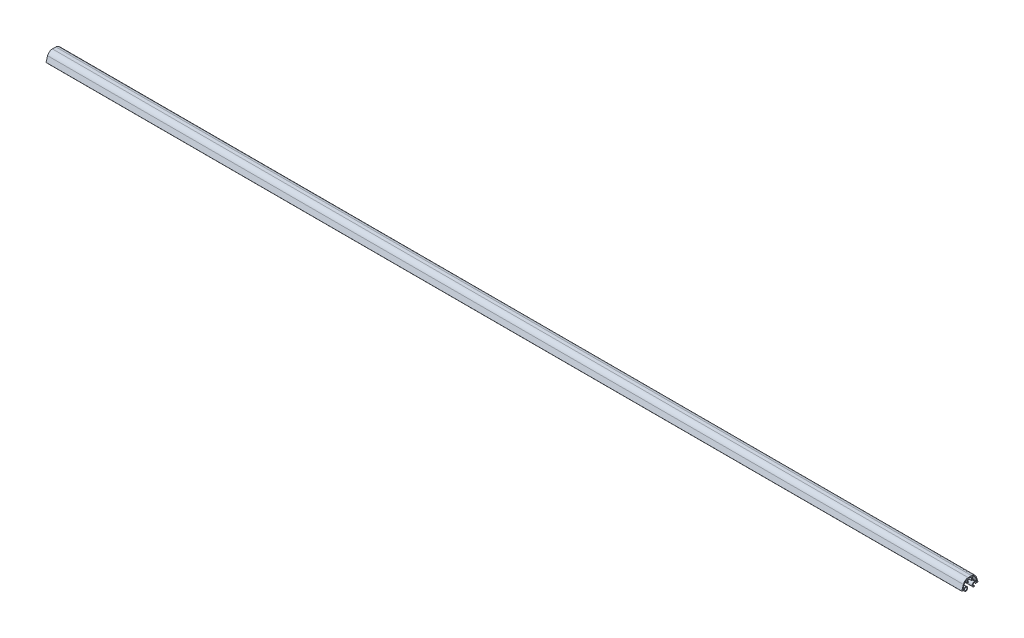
ISO-10303-21;
HEADER;
FILE_DESCRIPTION(('STEP AP214'),'2;1');
FILE_NAME('part.step','',(''),(''),'','','');
FILE_SCHEMA(('AUTOMOTIVE_DESIGN { 1 0 10303 214 1 1 1 1 }'));
ENDSEC;
DATA;
#1=APPLICATION_CONTEXT('core data for automotive mechanical design processes');
#2=APPLICATION_PROTOCOL_DEFINITION('international standard','automotive_design',2000,#1);
#3=PRODUCT_CONTEXT('',#1,'mechanical');
#4=PRODUCT('Part','Part','',(#3));
#5=PRODUCT_RELATED_PRODUCT_CATEGORY('part','',(#4));
#6=PRODUCT_DEFINITION_FORMATION('','',#4);
#7=PRODUCT_DEFINITION_CONTEXT('part definition',#1,'design');
#8=PRODUCT_DEFINITION('design','',#6,#7);
#9=PRODUCT_DEFINITION_SHAPE('','',#8);
#10=(LENGTH_UNIT() NAMED_UNIT(*) SI_UNIT(.MILLI.,.METRE.));
#11=(NAMED_UNIT(*) PLANE_ANGLE_UNIT() SI_UNIT($,.RADIAN.));
#12=(NAMED_UNIT(*) SI_UNIT($,.STERADIAN.) SOLID_ANGLE_UNIT());
#13=UNCERTAINTY_MEASURE_WITH_UNIT(LENGTH_MEASURE(1.E-05),#10,'distance_accuracy_value','');
#14=(GEOMETRIC_REPRESENTATION_CONTEXT(3) GLOBAL_UNCERTAINTY_ASSIGNED_CONTEXT((#13)) GLOBAL_UNIT_ASSIGNED_CONTEXT((#10,
#11,#12)) REPRESENTATION_CONTEXT('',''));
#15=CARTESIAN_POINT('',(0.,0.,0.));
#16=DIRECTION('',(0.,0.,1.));
#17=DIRECTION('',(1.,0.,0.));
#18=AXIS2_PLACEMENT_3D('',#15,#16,#17);
#19=CARTESIAN_POINT('',(1087.,0.,-2.));
#20=DIRECTION('',(-1.,0.,0.));
#21=DIRECTION('',(0.,0.,1.));
#22=AXIS2_PLACEMENT_3D('',#19,#20,#21);
#23=CYLINDRICAL_SURFACE('',#22,6.);
#24=CARTESIAN_POINT('',(0.,0.,-2.));
#25=DIRECTION('',(1.,0.,0.));
#26=DIRECTION('',(0.,0.,-1.));
#27=AXIS2_PLACEMENT_3D('',#24,#25,#26);
#28=CIRCLE('',#27,6.);
#29=CARTESIAN_POINT('',(0.,1.84912600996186,-7.7079534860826));
#30=VERTEX_POINT('',#29);
#31=CARTESIAN_POINT('',(0.,6.,-1.99999999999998));
#32=VERTEX_POINT('',#31);
#33=EDGE_CURVE('E331',#30,#32,#28,.T.);
#34=ORIENTED_EDGE('',*,*,#33,.T.);
#35=DIRECTION('',(-1.,0.,0.));
#36=VECTOR('',#35,1.);
#37=CARTESIAN_POINT('',(1087.,6.,-1.99999999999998));
#38=LINE('',#37,#36);
#39=CARTESIAN_POINT('',(1087.,6.,-1.99999999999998));
#40=VERTEX_POINT('',#39);
#41=EDGE_CURVE('E11',#40,#32,#38,.T.);
#42=ORIENTED_EDGE('',*,*,#41,.F.);
#43=CARTESIAN_POINT('',(1087.,0.,-2.));
#44=DIRECTION('',(1.,0.,0.));
#45=DIRECTION('',(0.,0.,-1.));
#46=AXIS2_PLACEMENT_3D('',#43,#44,#45);
#47=CIRCLE('',#46,6.);
#48=CARTESIAN_POINT('',(1087.,1.84912600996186,-7.7079534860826));
#49=VERTEX_POINT('',#48);
#50=EDGE_CURVE('E415',#49,#40,#47,.T.);
#51=ORIENTED_EDGE('',*,*,#50,.F.);
#52=DIRECTION('',(-1.,0.,0.));
#53=VECTOR('',#52,1.);
#54=CARTESIAN_POINT('',(1087.,1.84912600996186,-7.7079534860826));
#55=LINE('',#54,#53);
#56=EDGE_CURVE('E327',#49,#30,#55,.T.);
#57=ORIENTED_EDGE('',*,*,#56,.T.);
#58=EDGE_LOOP('',(#34,#42,#51,#57));
#59=FACE_BOUND('',#58,.T.);
#60=ADVANCED_FACE('F32',(#59),#23,.T.);
#61=CARTESIAN_POINT('',(1087.,6.,-1.99999999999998));
#62=DIRECTION('',(0.,-1.,0.));
#63=DIRECTION('',(0.,0.,-1.));
#64=AXIS2_PLACEMENT_3D('',#61,#62,#63);
#65=PLANE('',#64);
#66=DIRECTION('',(0.,0.,1.));
#67=VECTOR('',#66,1.);
#68=CARTESIAN_POINT('',(0.,6.,-1.99999999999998));
#69=LINE('',#68,#67);
#70=CARTESIAN_POINT('',(0.,6.,1.99999999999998));
#71=VERTEX_POINT('',#70);
#72=EDGE_CURVE('E334',#32,#71,#69,.T.);
#73=ORIENTED_EDGE('',*,*,#72,.T.);
#74=DIRECTION('',(-1.,0.,0.));
#75=VECTOR('',#74,1.);
#76=CARTESIAN_POINT('',(1087.,6.,1.99999999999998));
#77=LINE('',#76,#75);
#78=CARTESIAN_POINT('',(1087.,6.,1.99999999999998));
#79=VERTEX_POINT('',#78);
#80=EDGE_CURVE('E40',#79,#71,#77,.T.);
#81=ORIENTED_EDGE('',*,*,#80,.F.);
#82=DIRECTION('',(0.,0.,1.));
#83=VECTOR('',#82,1.);
#84=CARTESIAN_POINT('',(1087.,6.,-1.99999999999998));
#85=LINE('',#84,#83);
#86=EDGE_CURVE('E193',#40,#79,#85,.T.);
#87=ORIENTED_EDGE('',*,*,#86,.F.);
#88=ORIENTED_EDGE('',*,*,#41,.T.);
#89=EDGE_LOOP('',(#73,#81,#87,#88));
#90=FACE_BOUND('',#89,.T.);
#91=ADVANCED_FACE('F643',(#90),#65,.F.);
#92=CARTESIAN_POINT('',(1087.,0.,2.));
#93=DIRECTION('',(-1.,0.,0.));
#94=DIRECTION('',(0.,0.,1.));
#95=AXIS2_PLACEMENT_3D('',#92,#93,#94);
#96=CYLINDRICAL_SURFACE('',#95,6.);
#97=CARTESIAN_POINT('',(0.,0.,2.));
#98=DIRECTION('',(1.,0.,0.));
#99=DIRECTION('',(0.,0.,1.));
#100=AXIS2_PLACEMENT_3D('',#97,#98,#99);
#101=CIRCLE('',#100,6.);
#102=CARTESIAN_POINT('',(0.,1.84912600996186,7.7079534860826));
#103=VERTEX_POINT('',#102);
#104=EDGE_CURVE('E336',#71,#103,#101,.T.);
#105=ORIENTED_EDGE('',*,*,#104,.T.);
#106=DIRECTION('',(-1.,0.,0.));
#107=VECTOR('',#106,1.);
#108=CARTESIAN_POINT('',(1087.,1.84912600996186,7.7079534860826));
#109=LINE('',#108,#107);
#110=CARTESIAN_POINT('',(1087.,1.84912600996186,7.7079534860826));
#111=VERTEX_POINT('',#110);
#112=EDGE_CURVE('E524',#111,#103,#109,.T.);
#113=ORIENTED_EDGE('',*,*,#112,.F.);
#114=CARTESIAN_POINT('',(1087.,0.,2.));
#115=DIRECTION('',(1.,0.,0.));
#116=DIRECTION('',(0.,0.,1.));
#117=AXIS2_PLACEMENT_3D('',#114,#115,#116);
#118=CIRCLE('',#117,6.);
#119=EDGE_CURVE('E532',#79,#111,#118,.T.);
#120=ORIENTED_EDGE('',*,*,#119,.F.);
#121=ORIENTED_EDGE('',*,*,#80,.T.);
#122=EDGE_LOOP('',(#105,#113,#120,#121));
#123=FACE_BOUND('',#122,.T.);
#124=ADVANCED_FACE('F530',(#123),#96,.T.);
#125=CARTESIAN_POINT('',(1087.,1.84912600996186,7.7079534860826));
#126=DIRECTION('',(0.,-0.308187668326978,-0.951325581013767));
#127=DIRECTION('',(0.,0.951325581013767,-0.308187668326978));
#128=AXIS2_PLACEMENT_3D('',#125,#126,#127);
#129=PLANE('',#128);
#130=DIRECTION('',(0.,-0.951325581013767,0.308187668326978));
#131=VECTOR('',#130,1.);
#132=CARTESIAN_POINT('',(0.,1.84912600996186,7.7079534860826));
#133=LINE('',#132,#131);
#134=CARTESIAN_POINT('',(0.,-4.0383624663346,9.61524094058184));
#135=VERTEX_POINT('',#134);
#136=EDGE_CURVE('E338',#103,#135,#133,.T.);
#137=ORIENTED_EDGE('',*,*,#136,.T.);
#138=DIRECTION('',(-1.,0.,0.));
#139=VECTOR('',#138,1.);
#140=CARTESIAN_POINT('',(1087.,-4.0383624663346,9.61524094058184));
#141=LINE('',#140,#139);
#142=CARTESIAN_POINT('',(1087.,-4.0383624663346,9.61524094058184));
#143=VERTEX_POINT('',#142);
#144=EDGE_CURVE('E521',#143,#135,#141,.T.);
#145=ORIENTED_EDGE('',*,*,#144,.F.);
#146=DIRECTION('',(0.,-0.951325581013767,0.308187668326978));
#147=VECTOR('',#146,1.);
#148=CARTESIAN_POINT('',(1087.,1.84912600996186,7.7079534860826));
#149=LINE('',#148,#147);
#150=EDGE_CURVE('E549',#111,#143,#149,.T.);
#151=ORIENTED_EDGE('',*,*,#150,.F.);
#152=ORIENTED_EDGE('',*,*,#112,.T.);
#153=EDGE_LOOP('',(#137,#145,#151,#152));
#154=FACE_BOUND('',#153,.T.);
#155=ADVANCED_FACE('F540',(#154),#129,.F.);
#156=CARTESIAN_POINT('',(1087.,-4.1,9.42497582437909));
#157=DIRECTION('',(-1.,0.,0.));
#158=DIRECTION('',(0.,0.,1.));
#159=AXIS2_PLACEMENT_3D('',#156,#157,#158);
#160=CYLINDRICAL_SURFACE('',#159,0.2);
#161=CARTESIAN_POINT('',(0.,-4.1,9.42497582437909));
#162=DIRECTION('',(1.,0.,0.));
#163=DIRECTION('',(0.,0.,-1.));
#164=AXIS2_PLACEMENT_3D('',#161,#162,#163);
#165=CIRCLE('',#164,0.2);
#166=CARTESIAN_POINT('',(0.,-4.3,9.42497582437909));
#167=VERTEX_POINT('',#166);
#168=EDGE_CURVE('E340',#135,#167,#165,.T.);
#169=ORIENTED_EDGE('',*,*,#168,.T.);
#170=DIRECTION('',(-1.,0.,0.));
#171=VECTOR('',#170,1.);
#172=CARTESIAN_POINT('',(1087.,-4.3,9.42497582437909));
#173=LINE('',#172,#171);
#174=CARTESIAN_POINT('',(1087.,-4.3,9.42497582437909));
#175=VERTEX_POINT('',#174);
#176=EDGE_CURVE('E518',#175,#167,#173,.T.);
#177=ORIENTED_EDGE('',*,*,#176,.F.);
#178=CARTESIAN_POINT('',(1087.,-4.1,9.42497582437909));
#179=DIRECTION('',(1.,0.,0.));
#180=DIRECTION('',(0.,0.,-1.));
#181=AXIS2_PLACEMENT_3D('',#178,#179,#180);
#182=CIRCLE('',#181,0.2);
#183=EDGE_CURVE('E546',#143,#175,#182,.T.);
#184=ORIENTED_EDGE('',*,*,#183,.F.);
#185=ORIENTED_EDGE('',*,*,#144,.T.);
#186=EDGE_LOOP('',(#169,#177,#184,#185));
#187=FACE_BOUND('',#186,.T.);
#188=ADVANCED_FACE('F544',(#187),#160,.T.);
#189=CARTESIAN_POINT('',(1087.,-4.3,7.6));
#190=DIRECTION('',(0.,1.,0.));
#191=DIRECTION('',(0.,0.,1.));
#192=AXIS2_PLACEMENT_3D('',#189,#190,#191);
#193=PLANE('',#192);
#194=DIRECTION('',(0.,0.,-1.));
#195=VECTOR('',#194,1.);
#196=CARTESIAN_POINT('',(0.,-4.3,7.6));
#197=LINE('',#196,#195);
#198=CARTESIAN_POINT('',(0.,-4.3,6.78819430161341));
#199=VERTEX_POINT('',#198);
#200=EDGE_CURVE('E343',#167,#199,#197,.T.);
#201=ORIENTED_EDGE('',*,*,#200,.T.);
#202=DIRECTION('',(-1.,0.,0.));
#203=VECTOR('',#202,1.);
#204=CARTESIAN_POINT('',(1087.,-4.3,6.78819430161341));
#205=LINE('',#204,#203);
#206=CARTESIAN_POINT('',(1087.,-4.3,6.78819430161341));
#207=VERTEX_POINT('',#206);
#208=EDGE_CURVE('E515',#207,#199,#205,.T.);
#209=ORIENTED_EDGE('',*,*,#208,.F.);
#210=DIRECTION('',(0.,0.,-1.));
#211=VECTOR('',#210,1.);
#212=CARTESIAN_POINT('',(1087.,-4.3,9.42497582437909));
#213=LINE('',#212,#211);
#214=EDGE_CURVE('E548',#175,#207,#213,.T.);
#215=ORIENTED_EDGE('',*,*,#214,.F.);
#216=ORIENTED_EDGE('',*,*,#176,.T.);
#217=EDGE_LOOP('',(#201,#209,#215,#216));
#218=FACE_BOUND('',#217,.T.);
#219=ADVANCED_FACE('F656',(#218),#193,.F.);
#220=CARTESIAN_POINT('',(1087.,-4.1,6.78819430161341));
#221=DIRECTION('',(-1.,0.,0.));
#222=DIRECTION('',(0.,0.,1.));
#223=AXIS2_PLACEMENT_3D('',#220,#221,#222);
#224=CYLINDRICAL_SURFACE('',#223,0.2);
#225=CARTESIAN_POINT('',(0.,-4.1,6.78819430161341));
#226=DIRECTION('',(1.,0.,0.));
#227=DIRECTION('',(0.,0.,-1.));
#228=AXIS2_PLACEMENT_3D('',#225,#226,#227);
#229=CIRCLE('',#228,0.2);
#230=CARTESIAN_POINT('',(0.,-4.1235294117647,6.58958320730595));
#231=VERTEX_POINT('',#230);
#232=EDGE_CURVE('E345',#199,#231,#229,.T.);
#233=ORIENTED_EDGE('',*,*,#232,.T.);
#234=DIRECTION('',(-1.,0.,0.));
#235=VECTOR('',#234,1.);
#236=CARTESIAN_POINT('',(1087.,-4.1235294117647,6.58958320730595));
#237=LINE('',#236,#235);
#238=CARTESIAN_POINT('',(1087.,-4.1235294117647,6.58958320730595));
#239=VERTEX_POINT('',#238);
#240=EDGE_CURVE('E512',#239,#231,#237,.T.);
#241=ORIENTED_EDGE('',*,*,#240,.F.);
#242=CARTESIAN_POINT('',(1087.,-4.1,6.78819430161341));
#243=DIRECTION('',(1.,0.,0.));
#244=DIRECTION('',(0.,0.,-1.));
#245=AXIS2_PLACEMENT_3D('',#242,#243,#244);
#246=CIRCLE('',#245,0.2);
#247=EDGE_CURVE('E551',#207,#239,#246,.T.);
#248=ORIENTED_EDGE('',*,*,#247,.F.);
#249=ORIENTED_EDGE('',*,*,#208,.T.);
#250=EDGE_LOOP('',(#233,#241,#248,#249));
#251=FACE_BOUND('',#250,.T.);
#252=ADVANCED_FACE('F659',(#251),#224,.T.);
#253=CARTESIAN_POINT('',(1087.,-4.29999999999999,5.1));
#254=DIRECTION('',(-1.,0.,0.));
#255=DIRECTION('',(0.,0.,1.));
#256=AXIS2_PLACEMENT_3D('',#253,#254,#255);
#257=CYLINDRICAL_SURFACE('',#256,1.5);
#258=CARTESIAN_POINT('',(0.,-4.29999999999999,5.1));
#259=DIRECTION('',(-1.,0.,0.));
#260=DIRECTION('',(0.,0.,1.));
#261=AXIS2_PLACEMENT_3D('',#258,#259,#260);
#262=CIRCLE('',#261,1.5);
#263=CARTESIAN_POINT('',(0.,-5.79592574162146,5.21048156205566));
#264=VERTEX_POINT('',#263);
#265=EDGE_CURVE('E347',#231,#264,#262,.T.);
#266=ORIENTED_EDGE('',*,*,#265,.T.);
#267=DIRECTION('',(-1.,0.,0.));
#268=VECTOR('',#267,1.);
#269=CARTESIAN_POINT('',(1087.,-5.79592574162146,5.21048156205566));
#270=LINE('',#269,#268);
#271=CARTESIAN_POINT('',(1087.,-5.79592574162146,5.21048156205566));
#272=VERTEX_POINT('',#271);
#273=EDGE_CURVE('E509',#272,#264,#270,.T.);
#274=ORIENTED_EDGE('',*,*,#273,.F.);
#275=CARTESIAN_POINT('',(1087.,-4.29999999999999,5.1));
#276=DIRECTION('',(-1.,0.,0.));
#277=DIRECTION('',(0.,0.,1.));
#278=AXIS2_PLACEMENT_3D('',#275,#276,#277);
#279=CIRCLE('',#278,1.5);
#280=EDGE_CURVE('E557',#239,#272,#279,.T.);
#281=ORIENTED_EDGE('',*,*,#280,.F.);
#282=ORIENTED_EDGE('',*,*,#240,.T.);
#283=EDGE_LOOP('',(#266,#274,#281,#282));
#284=FACE_BOUND('',#283,.T.);
#285=ADVANCED_FACE('F663',(#284),#257,.F.);
#286=CARTESIAN_POINT('',(1087.,-6.19483927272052,5.23994331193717));
#287=DIRECTION('',(-1.,0.,0.));
#288=DIRECTION('',(0.,0.,1.));
#289=AXIS2_PLACEMENT_3D('',#286,#287,#288);
#290=CYLINDRICAL_SURFACE('',#289,0.4);
#291=CARTESIAN_POINT('',(0.,-6.19483927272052,5.23994331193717));
#292=DIRECTION('',(1.,0.,0.));
#293=DIRECTION('',(0.,0.,1.));
#294=AXIS2_PLACEMENT_3D('',#291,#292,#293);
#295=CIRCLE('',#294,0.4);
#296=CARTESIAN_POINT('',(0.,-6.0820560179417,5.62371399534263));
#297=VERTEX_POINT('',#296);
#298=EDGE_CURVE('E349',#264,#297,#295,.T.);
#299=ORIENTED_EDGE('',*,*,#298,.T.);
#300=DIRECTION('',(-1.,0.,0.));
#301=VECTOR('',#300,1.);
#302=CARTESIAN_POINT('',(1087.,-6.0820560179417,5.62371399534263));
#303=LINE('',#302,#301);
#304=CARTESIAN_POINT('',(1087.,-6.0820560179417,5.62371399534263));
#305=VERTEX_POINT('',#304);
#306=EDGE_CURVE('E506',#305,#297,#303,.T.);
#307=ORIENTED_EDGE('',*,*,#306,.F.);
#308=CARTESIAN_POINT('',(1087.,-6.19483927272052,5.23994331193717));
#309=DIRECTION('',(1.,0.,0.));
#310=DIRECTION('',(0.,0.,1.));
#311=AXIS2_PLACEMENT_3D('',#308,#309,#310);
#312=CIRCLE('',#311,0.4);
#313=EDGE_CURVE('E559',#272,#305,#312,.T.);
#314=ORIENTED_EDGE('',*,*,#313,.F.);
#315=ORIENTED_EDGE('',*,*,#273,.T.);
#316=EDGE_LOOP('',(#299,#307,#314,#315));
#317=FACE_BOUND('',#316,.T.);
#318=ADVANCED_FACE('F667',(#317),#290,.T.);
#319=CARTESIAN_POINT('',(1087.,-6.0820560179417,5.62371399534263));
#320=DIRECTION('',(0.,-0.281958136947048,-0.959426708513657));
#321=DIRECTION('',(0.,0.959426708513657,-0.281958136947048));
#322=AXIS2_PLACEMENT_3D('',#319,#320,#321);
#323=PLANE('',#322);
#324=DIRECTION('',(0.,-0.959426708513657,0.281958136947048));
#325=VECTOR('',#324,1.);
#326=CARTESIAN_POINT('',(0.,-6.0820560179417,5.62371399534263));
#327=LINE('',#326,#325);
#328=CARTESIAN_POINT('',(0.,-6.27790882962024,5.68127159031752));
#329=VERTEX_POINT('',#328);
#330=EDGE_CURVE('E351',#297,#329,#327,.T.);
#331=ORIENTED_EDGE('',*,*,#330,.T.);
#332=DIRECTION('',(-1.,0.,0.));
#333=VECTOR('',#332,1.);
#334=CARTESIAN_POINT('',(1087.,-6.27790882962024,5.68127159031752));
#335=LINE('',#334,#333);
#336=CARTESIAN_POINT('',(1087.,-6.27790882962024,5.68127159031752));
#337=VERTEX_POINT('',#336);
#338=EDGE_CURVE('E503',#337,#329,#335,.T.);
#339=ORIENTED_EDGE('',*,*,#338,.F.);
#340=DIRECTION('',(0.,-0.959426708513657,0.281958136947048));
#341=VECTOR('',#340,1.);
#342=CARTESIAN_POINT('',(1087.,-6.0820560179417,5.62371399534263));
#343=LINE('',#342,#341);
#344=EDGE_CURVE('E561',#305,#337,#343,.T.);
#345=ORIENTED_EDGE('',*,*,#344,.F.);
#346=ORIENTED_EDGE('',*,*,#306,.T.);
#347=EDGE_LOOP('',(#331,#339,#345,#346));
#348=FACE_BOUND('',#347,.T.);
#349=ADVANCED_FACE('F671',(#348),#323,.F.);
#350=CARTESIAN_POINT('',(1087.,-6.39069208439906,5.29750090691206));
#351=DIRECTION('',(-1.,0.,0.));
#352=DIRECTION('',(0.,0.,1.));
#353=AXIS2_PLACEMENT_3D('',#350,#351,#352);
#354=CYLINDRICAL_SURFACE('',#353,0.400000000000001);
#355=CARTESIAN_POINT('',(0.,-6.39069208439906,5.29750090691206));
#356=DIRECTION('',(1.,0.,0.));
#357=DIRECTION('',(0.,0.,-1.));
#358=AXIS2_PLACEMENT_3D('',#355,#356,#357);
#359=CIRCLE('',#358,0.400000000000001);
#360=CARTESIAN_POINT('',(0.,-6.78891914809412,5.33512012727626));
#361=VERTEX_POINT('',#360);
#362=EDGE_CURVE('E353',#329,#361,#359,.T.);
#363=ORIENTED_EDGE('',*,*,#362,.T.);
#364=DIRECTION('',(-1.,0.,0.));
#365=VECTOR('',#364,1.);
#366=CARTESIAN_POINT('',(1087.,-6.78891914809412,5.33512012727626));
#367=LINE('',#366,#365);
#368=CARTESIAN_POINT('',(1087.,-6.78891914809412,5.33512012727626));
#369=VERTEX_POINT('',#368);
#370=EDGE_CURVE('E500',#369,#361,#367,.T.);
#371=ORIENTED_EDGE('',*,*,#370,.F.);
#372=CARTESIAN_POINT('',(1087.,-6.39069208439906,5.29750090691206));
#373=DIRECTION('',(1.,0.,0.));
#374=DIRECTION('',(0.,0.,-1.));
#375=AXIS2_PLACEMENT_3D('',#372,#373,#374);
#376=CIRCLE('',#375,0.400000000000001);
#377=EDGE_CURVE('E563',#337,#369,#376,.T.);
#378=ORIENTED_EDGE('',*,*,#377,.F.);
#379=ORIENTED_EDGE('',*,*,#338,.T.);
#380=EDGE_LOOP('',(#363,#371,#378,#379));
#381=FACE_BOUND('',#380,.T.);
#382=ADVANCED_FACE('F675',(#381),#354,.T.);
#383=CARTESIAN_POINT('',(1087.,-4.29999999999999,5.1));
#384=DIRECTION('',(-1.,0.,0.));
#385=DIRECTION('',(0.,0.,1.));
#386=AXIS2_PLACEMENT_3D('',#383,#384,#385);
#387=CYLINDRICAL_SURFACE('',#386,2.5);
#388=CARTESIAN_POINT('',(0.,-4.29999999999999,5.1));
#389=DIRECTION('',(1.,0.,0.));
#390=DIRECTION('',(0.,0.,1.));
#391=AXIS2_PLACEMENT_3D('',#388,#389,#390);
#392=CIRCLE('',#391,2.5);
#393=CARTESIAN_POINT('',(0.,-3.09310344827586,7.28938363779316));
#394=VERTEX_POINT('',#393);
#395=EDGE_CURVE('E355',#361,#394,#392,.T.);
#396=ORIENTED_EDGE('',*,*,#395,.T.);
#397=DIRECTION('',(-1.,0.,0.));
#398=VECTOR('',#397,1.);
#399=CARTESIAN_POINT('',(1087.,-3.09310344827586,7.28938363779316));
#400=LINE('',#399,#398);
#401=CARTESIAN_POINT('',(1087.,-3.09310344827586,7.28938363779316));
#402=VERTEX_POINT('',#401);
#403=EDGE_CURVE('E497',#402,#394,#400,.T.);
#404=ORIENTED_EDGE('',*,*,#403,.F.);
#405=CARTESIAN_POINT('',(1087.,-4.29999999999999,5.1));
#406=DIRECTION('',(1.,0.,0.));
#407=DIRECTION('',(0.,0.,1.));
#408=AXIS2_PLACEMENT_3D('',#405,#406,#407);
#409=CIRCLE('',#408,2.5);
#410=EDGE_CURVE('E565',#369,#402,#409,.T.);
#411=ORIENTED_EDGE('',*,*,#410,.F.);
#412=ORIENTED_EDGE('',*,*,#370,.T.);
#413=EDGE_LOOP('',(#396,#404,#411,#412));
#414=FACE_BOUND('',#413,.T.);
#415=ADVANCED_FACE('F679',(#414),#387,.T.);
#416=CARTESIAN_POINT('',(1087.,-2.9,7.63968501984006));
#417=DIRECTION('',(-1.,0.,0.));
#418=DIRECTION('',(0.,0.,1.));
#419=AXIS2_PLACEMENT_3D('',#416,#417,#418);
#420=CYLINDRICAL_SURFACE('',#419,0.4);
#421=CARTESIAN_POINT('',(0.,-2.9,7.63968501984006));
#422=DIRECTION('',(-1.,0.,0.));
#423=DIRECTION('',(0.,0.,-1.));
#424=AXIS2_PLACEMENT_3D('',#421,#422,#423);
#425=CIRCLE('',#424,0.4);
#426=CARTESIAN_POINT('',(0.,-3.3,7.63968501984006));
#427=VERTEX_POINT('',#426);
#428=EDGE_CURVE('E357',#394,#427,#425,.T.);
#429=ORIENTED_EDGE('',*,*,#428,.T.);
#430=DIRECTION('',(-1.,0.,0.));
#431=VECTOR('',#430,1.);
#432=CARTESIAN_POINT('',(1087.,-3.3,7.63968501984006));
#433=LINE('',#432,#431);
#434=CARTESIAN_POINT('',(1087.,-3.3,7.63968501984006));
#435=VERTEX_POINT('',#434);
#436=EDGE_CURVE('E494',#435,#427,#433,.T.);
#437=ORIENTED_EDGE('',*,*,#436,.F.);
#438=CARTESIAN_POINT('',(1087.,-2.9,7.63968501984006));
#439=DIRECTION('',(-1.,0.,0.));
#440=DIRECTION('',(0.,0.,-1.));
#441=AXIS2_PLACEMENT_3D('',#438,#439,#440);
#442=CIRCLE('',#441,0.4);
#443=EDGE_CURVE('E567',#402,#435,#442,.T.);
#444=ORIENTED_EDGE('',*,*,#443,.F.);
#445=ORIENTED_EDGE('',*,*,#403,.T.);
#446=EDGE_LOOP('',(#429,#437,#444,#445));
#447=FACE_BOUND('',#446,.T.);
#448=ADVANCED_FACE('F683',(#447),#420,.F.);
#449=CARTESIAN_POINT('',(1087.,-3.3,7.85843194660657));
#450=DIRECTION('',(0.,-1.,0.));
#451=DIRECTION('',(0.,0.,-1.));
#452=AXIS2_PLACEMENT_3D('',#449,#450,#451);
#453=PLANE('',#452);
#454=DIRECTION('',(0.,0.,1.));
#455=VECTOR('',#454,1.);
#456=CARTESIAN_POINT('',(0.,-3.3,7.85843194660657));
#457=LINE('',#456,#455);
#458=CARTESIAN_POINT('',(0.,-3.3,7.85843194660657));
#459=VERTEX_POINT('',#458);
#460=EDGE_CURVE('E359',#427,#459,#457,.T.);
#461=ORIENTED_EDGE('',*,*,#460,.T.);
#462=DIRECTION('',(-1.,0.,0.));
#463=VECTOR('',#462,1.);
#464=CARTESIAN_POINT('',(1087.,-3.3,7.85843194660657));
#465=LINE('',#464,#463);
#466=CARTESIAN_POINT('',(1087.,-3.3,7.85843194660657));
#467=VERTEX_POINT('',#466);
#468=EDGE_CURVE('E491',#467,#459,#465,.T.);
#469=ORIENTED_EDGE('',*,*,#468,.F.);
#470=DIRECTION('',(0.,0.,1.));
#471=VECTOR('',#470,1.);
#472=CARTESIAN_POINT('',(1087.,-3.3,7.85843194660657));
#473=LINE('',#472,#471);
#474=EDGE_CURVE('E569',#435,#467,#473,.T.);
#475=ORIENTED_EDGE('',*,*,#474,.F.);
#476=ORIENTED_EDGE('',*,*,#436,.T.);
#477=EDGE_LOOP('',(#461,#469,#475,#476));
#478=FACE_BOUND('',#477,.T.);
#479=ADVANCED_FACE('F687',(#478),#453,.F.);
#480=CARTESIAN_POINT('',(1087.,-2.9,7.85843194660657));
#481=DIRECTION('',(-1.,0.,0.));
#482=DIRECTION('',(0.,0.,1.));
#483=AXIS2_PLACEMENT_3D('',#480,#481,#482);
#484=CYLINDRICAL_SURFACE('',#483,0.4);
#485=CARTESIAN_POINT('',(0.,-2.9,7.85843194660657));
#486=DIRECTION('',(-1.,0.,0.));
#487=DIRECTION('',(0.,0.,1.));
#488=AXIS2_PLACEMENT_3D('',#485,#486,#487);
#489=CIRCLE('',#488,0.4);
#490=CARTESIAN_POINT('',(0.,-2.77010253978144,8.2367527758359));
#491=VERTEX_POINT('',#490);
#492=EDGE_CURVE('E361',#459,#491,#489,.T.);
#493=ORIENTED_EDGE('',*,*,#492,.T.);
#494=DIRECTION('',(-1.,0.,0.));
#495=VECTOR('',#494,1.);
#496=CARTESIAN_POINT('',(1087.,-2.77010253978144,8.2367527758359));
#497=LINE('',#496,#495);
#498=CARTESIAN_POINT('',(1087.,-2.77010253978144,8.2367527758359));
#499=VERTEX_POINT('',#498);
#500=EDGE_CURVE('E488',#499,#491,#497,.T.);
#501=ORIENTED_EDGE('',*,*,#500,.F.);
#502=CARTESIAN_POINT('',(1087.,-2.9,7.85843194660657));
#503=DIRECTION('',(-1.,0.,0.));
#504=DIRECTION('',(0.,0.,1.));
#505=AXIS2_PLACEMENT_3D('',#502,#503,#504);
#506=CIRCLE('',#505,0.4);
#507=EDGE_CURVE('E571',#467,#499,#506,.T.);
#508=ORIENTED_EDGE('',*,*,#507,.F.);
#509=ORIENTED_EDGE('',*,*,#468,.T.);
#510=EDGE_LOOP('',(#493,#501,#508,#509));
#511=FACE_BOUND('',#510,.T.);
#512=ADVANCED_FACE('F691',(#511),#484,.F.);
#513=CARTESIAN_POINT('',(1087.,1.71010071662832,6.69846310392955));
#514=DIRECTION('',(0.,0.324743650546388,0.945802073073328));
#515=DIRECTION('',(0.,-0.945802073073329,0.324743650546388));
#516=AXIS2_PLACEMENT_3D('',#513,#514,#515);
#517=PLANE('',#516);
#518=DIRECTION('',(0.,0.945802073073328,-0.324743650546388));
#519=VECTOR('',#518,1.);
#520=CARTESIAN_POINT('',(0.,1.71010071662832,6.69846310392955));
#521=LINE('',#520,#519);
#522=CARTESIAN_POINT('',(0.,1.71010071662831,6.69846310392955));
#523=VERTEX_POINT('',#522);
#524=EDGE_CURVE('E363',#491,#523,#521,.T.);
#525=ORIENTED_EDGE('',*,*,#524,.T.);
#526=DIRECTION('',(-1.,0.,0.));
#527=VECTOR('',#526,1.);
#528=CARTESIAN_POINT('',(1087.,1.71010071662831,6.69846310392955));
#529=LINE('',#528,#527);
#530=CARTESIAN_POINT('',(1087.,1.71010071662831,6.69846310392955));
#531=VERTEX_POINT('',#530);
#532=EDGE_CURVE('E485',#531,#523,#529,.T.);
#533=ORIENTED_EDGE('',*,*,#532,.F.);
#534=DIRECTION('',(0.,0.945802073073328,-0.324743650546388));
#535=VECTOR('',#534,1.);
#536=CARTESIAN_POINT('',(1087.,1.71010071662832,6.69846310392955));
#537=LINE('',#536,#535);
#538=EDGE_CURVE('E573',#499,#531,#537,.T.);
#539=ORIENTED_EDGE('',*,*,#538,.F.);
#540=ORIENTED_EDGE('',*,*,#500,.T.);
#541=EDGE_LOOP('',(#525,#533,#539,#540));
#542=FACE_BOUND('',#541,.T.);
#543=ADVANCED_FACE('F695',(#542),#517,.F.);
#544=CARTESIAN_POINT('',(1087.,0.,2.));
#545=DIRECTION('',(-1.,0.,0.));
#546=DIRECTION('',(0.,0.,1.));
#547=AXIS2_PLACEMENT_3D('',#544,#545,#546);
#548=CYLINDRICAL_SURFACE('',#547,5.);
#549=CARTESIAN_POINT('',(0.,0.,2.));
#550=DIRECTION('',(-1.,0.,0.));
#551=DIRECTION('',(0.,0.,1.));
#552=AXIS2_PLACEMENT_3D('',#549,#550,#551);
#553=CIRCLE('',#552,5.);
#554=CARTESIAN_POINT('',(0.,4.94064883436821,2.76810747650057));
#555=VERTEX_POINT('',#554);
#556=EDGE_CURVE('E365',#523,#555,#553,.T.);
#557=ORIENTED_EDGE('',*,*,#556,.T.);
#558=DIRECTION('',(-1.,0.,0.));
#559=VECTOR('',#558,1.);
#560=CARTESIAN_POINT('',(1087.,4.94064883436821,2.76810747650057));
#561=LINE('',#560,#559);
#562=CARTESIAN_POINT('',(1087.,4.94064883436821,2.76810747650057));
#563=VERTEX_POINT('',#562);
#564=EDGE_CURVE('E482',#563,#555,#561,.T.);
#565=ORIENTED_EDGE('',*,*,#564,.F.);
#566=CARTESIAN_POINT('',(1087.,0.,2.));
#567=DIRECTION('',(-1.,0.,0.));
#568=DIRECTION('',(0.,0.,1.));
#569=AXIS2_PLACEMENT_3D('',#566,#567,#568);
#570=CIRCLE('',#569,5.);
#571=EDGE_CURVE('E575',#531,#563,#570,.T.);
#572=ORIENTED_EDGE('',*,*,#571,.F.);
#573=ORIENTED_EDGE('',*,*,#532,.T.);
#574=EDGE_LOOP('',(#557,#565,#572,#573));
#575=FACE_BOUND('',#574,.T.);
#576=ADVANCED_FACE('F699',(#575),#548,.F.);
#577=CARTESIAN_POINT('',(1087.,4.74302288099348,2.73738317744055));
#578=DIRECTION('',(-1.,0.,0.));
#579=DIRECTION('',(0.,0.,1.));
#580=AXIS2_PLACEMENT_3D('',#577,#578,#579);
#581=CYLINDRICAL_SURFACE('',#580,0.2);
#582=CARTESIAN_POINT('',(0.,4.74302288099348,2.73738317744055));
#583=DIRECTION('',(-1.,0.,0.));
#584=DIRECTION('',(0.,0.,1.));
#585=AXIS2_PLACEMENT_3D('',#582,#583,#584);
#586=CIRCLE('',#585,0.2);
#587=CARTESIAN_POINT('',(0.,4.63132452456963,2.57148116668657));
#588=VERTEX_POINT('',#587);
#589=EDGE_CURVE('E367',#555,#588,#586,.T.);
#590=ORIENTED_EDGE('',*,*,#589,.T.);
#591=DIRECTION('',(-1.,0.,0.));
#592=VECTOR('',#591,1.);
#593=CARTESIAN_POINT('',(1087.,4.63132452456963,2.57148116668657));
#594=LINE('',#593,#592);
#595=CARTESIAN_POINT('',(1087.,4.63132452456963,2.57148116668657));
#596=VERTEX_POINT('',#595);
#597=EDGE_CURVE('E479',#596,#588,#594,.T.);
#598=ORIENTED_EDGE('',*,*,#597,.F.);
#599=CARTESIAN_POINT('',(1087.,4.74302288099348,2.73738317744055));
#600=DIRECTION('',(-1.,0.,0.));
#601=DIRECTION('',(0.,0.,1.));
#602=AXIS2_PLACEMENT_3D('',#599,#600,#601);
#603=CIRCLE('',#602,0.2);
#604=EDGE_CURVE('E577',#563,#596,#603,.T.);
#605=ORIENTED_EDGE('',*,*,#604,.F.);
#606=ORIENTED_EDGE('',*,*,#564,.T.);
#607=EDGE_LOOP('',(#590,#598,#605,#606));
#608=FACE_BOUND('',#607,.T.);
#609=ADVANCED_FACE('F703',(#608),#581,.F.);
#610=CARTESIAN_POINT('',(1087.,2.9,0.));
#611=DIRECTION('',(-1.,0.,0.));
#612=DIRECTION('',(0.,0.,1.));
#613=AXIS2_PLACEMENT_3D('',#610,#611,#612);
#614=CYLINDRICAL_SURFACE('',#613,3.1);
#615=CARTESIAN_POINT('',(0.,2.9,0.));
#616=DIRECTION('',(1.,0.,0.));
#617=DIRECTION('',(0.,0.,1.));
#618=AXIS2_PLACEMENT_3D('',#615,#616,#617);
#619=CIRCLE('',#618,3.1);
#620=CARTESIAN_POINT('',(0.,1.17777777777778,2.5775861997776));
#621=VERTEX_POINT('',#620);
#622=EDGE_CURVE('E369',#588,#621,#619,.T.);
#623=ORIENTED_EDGE('',*,*,#622,.T.);
#624=DIRECTION('',(-1.,0.,0.));
#625=VECTOR('',#624,1.);
#626=CARTESIAN_POINT('',(1087.,1.17777777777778,2.5775861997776));
#627=LINE('',#626,#625);
#628=CARTESIAN_POINT('',(1087.,1.17777777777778,2.5775861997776));
#629=VERTEX_POINT('',#628);
#630=EDGE_CURVE('E476',#629,#621,#627,.T.);
#631=ORIENTED_EDGE('',*,*,#630,.F.);
#632=CARTESIAN_POINT('',(1087.,2.9,0.));
#633=DIRECTION('',(1.,0.,0.));
#634=DIRECTION('',(0.,0.,1.));
#635=AXIS2_PLACEMENT_3D('',#632,#633,#634);
#636=CIRCLE('',#635,3.1);
#637=EDGE_CURVE('E579',#596,#629,#636,.T.);
#638=ORIENTED_EDGE('',*,*,#637,.F.);
#639=ORIENTED_EDGE('',*,*,#597,.T.);
#640=EDGE_LOOP('',(#623,#631,#638,#639));
#641=FACE_BOUND('',#640,.T.);
#642=ADVANCED_FACE('F707',(#641),#614,.T.);
#643=CARTESIAN_POINT('',(1087.,1.4,2.24499443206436));
#644=DIRECTION('',(-1.,0.,0.));
#645=DIRECTION('',(0.,0.,1.));
#646=AXIS2_PLACEMENT_3D('',#643,#644,#645);
#647=CYLINDRICAL_SURFACE('',#646,0.4);
#648=CARTESIAN_POINT('',(0.,1.4,2.24499443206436));
#649=DIRECTION('',(1.,0.,0.));
#650=DIRECTION('',(0.,0.,-1.));
#651=AXIS2_PLACEMENT_3D('',#648,#649,#650);
#652=CIRCLE('',#651,0.4);
#653=CARTESIAN_POINT('',(0.,1.,2.24499443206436));
#654=VERTEX_POINT('',#653);
#655=EDGE_CURVE('E371',#621,#654,#652,.T.);
#656=ORIENTED_EDGE('',*,*,#655,.T.);
#657=DIRECTION('',(-1.,0.,0.));
#658=VECTOR('',#657,1.);
#659=CARTESIAN_POINT('',(1087.,1.,2.24499443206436));
#660=LINE('',#659,#658);
#661=CARTESIAN_POINT('',(1087.,1.,2.24499443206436));
#662=VERTEX_POINT('',#661);
#663=EDGE_CURVE('E473',#662,#654,#660,.T.);
#664=ORIENTED_EDGE('',*,*,#663,.F.);
#665=CARTESIAN_POINT('',(1087.,1.4,2.24499443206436));
#666=DIRECTION('',(1.,0.,0.));
#667=DIRECTION('',(0.,0.,-1.));
#668=AXIS2_PLACEMENT_3D('',#665,#666,#667);
#669=CIRCLE('',#668,0.4);
#670=EDGE_CURVE('E581',#629,#662,#669,.T.);
#671=ORIENTED_EDGE('',*,*,#670,.F.);
#672=ORIENTED_EDGE('',*,*,#630,.T.);
#673=EDGE_LOOP('',(#656,#664,#671,#672));
#674=FACE_BOUND('',#673,.T.);
#675=ADVANCED_FACE('F711',(#674),#647,.T.);
#676=CARTESIAN_POINT('',(1087.,1.,2.24499443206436));
#677=DIRECTION('',(0.,1.,0.));
#678=DIRECTION('',(0.,0.,1.));
#679=AXIS2_PLACEMENT_3D('',#676,#677,#678);
#680=PLANE('',#679);
#681=DIRECTION('',(0.,0.,-1.));
#682=VECTOR('',#681,1.);
#683=CARTESIAN_POINT('',(0.,1.,2.24499443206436));
#684=LINE('',#683,#682);
#685=CARTESIAN_POINT('',(0.,1.,2.));
#686=VERTEX_POINT('',#685);
#687=EDGE_CURVE('E373',#654,#686,#684,.T.);
#688=ORIENTED_EDGE('',*,*,#687,.T.);
#689=DIRECTION('',(-1.,0.,0.));
#690=VECTOR('',#689,1.);
#691=CARTESIAN_POINT('',(1087.,1.,2.));
#692=LINE('',#691,#690);
#693=CARTESIAN_POINT('',(1087.,1.,2.));
#694=VERTEX_POINT('',#693);
#695=EDGE_CURVE('E470',#694,#686,#692,.T.);
#696=ORIENTED_EDGE('',*,*,#695,.F.);
#697=DIRECTION('',(0.,0.,-1.));
#698=VECTOR('',#697,1.);
#699=CARTESIAN_POINT('',(1087.,1.,2.24499443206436));
#700=LINE('',#699,#698);
#701=EDGE_CURVE('E583',#662,#694,#700,.T.);
#702=ORIENTED_EDGE('',*,*,#701,.F.);
#703=ORIENTED_EDGE('',*,*,#663,.T.);
#704=EDGE_LOOP('',(#688,#696,#702,#703));
#705=FACE_BOUND('',#704,.T.);
#706=ADVANCED_FACE('F715',(#705),#680,.F.);
#707=CARTESIAN_POINT('',(1087.,1.4,2.));
#708=DIRECTION('',(-1.,0.,0.));
#709=DIRECTION('',(0.,0.,1.));
#710=AXIS2_PLACEMENT_3D('',#707,#708,#709);
#711=CYLINDRICAL_SURFACE('',#710,0.4);
#712=CARTESIAN_POINT('',(0.,1.4,2.));
#713=DIRECTION('',(1.,0.,0.));
#714=DIRECTION('',(0.,0.,1.));
#715=AXIS2_PLACEMENT_3D('',#712,#713,#714);
#716=CIRCLE('',#715,0.4);
#717=CARTESIAN_POINT('',(0.,1.64,1.68));
#718=VERTEX_POINT('',#717);
#719=EDGE_CURVE('E375',#686,#718,#716,.T.);
#720=ORIENTED_EDGE('',*,*,#719,.T.);
#721=DIRECTION('',(-1.,0.,0.));
#722=VECTOR('',#721,1.);
#723=CARTESIAN_POINT('',(1087.,1.64,1.68));
#724=LINE('',#723,#722);
#725=CARTESIAN_POINT('',(1087.,1.64,1.68));
#726=VERTEX_POINT('',#725);
#727=EDGE_CURVE('E467',#726,#718,#724,.T.);
#728=ORIENTED_EDGE('',*,*,#727,.F.);
#729=CARTESIAN_POINT('',(1087.,1.4,2.));
#730=DIRECTION('',(1.,0.,0.));
#731=DIRECTION('',(0.,0.,1.));
#732=AXIS2_PLACEMENT_3D('',#729,#730,#731);
#733=CIRCLE('',#732,0.4);
#734=EDGE_CURVE('E585',#694,#726,#733,.T.);
#735=ORIENTED_EDGE('',*,*,#734,.F.);
#736=ORIENTED_EDGE('',*,*,#695,.T.);
#737=EDGE_LOOP('',(#720,#728,#735,#736));
#738=FACE_BOUND('',#737,.T.);
#739=ADVANCED_FACE('F719',(#738),#711,.T.);
#740=CARTESIAN_POINT('',(1087.,2.9,0.));
#741=DIRECTION('',(-1.,0.,0.));
#742=DIRECTION('',(0.,0.,1.));
#743=AXIS2_PLACEMENT_3D('',#740,#741,#742);
#744=CYLINDRICAL_SURFACE('',#743,2.1);
#745=CARTESIAN_POINT('',(0.,2.9,0.));
#746=DIRECTION('',(-1.,0.,0.));
#747=DIRECTION('',(0.,0.,-1.));
#748=AXIS2_PLACEMENT_3D('',#745,#746,#747);
#749=CIRCLE('',#748,2.1);
#750=CARTESIAN_POINT('',(0.,1.64,-1.68));
#751=VERTEX_POINT('',#750);
#752=EDGE_CURVE('E377',#718,#751,#749,.T.);
#753=ORIENTED_EDGE('',*,*,#752,.T.);
#754=DIRECTION('',(-1.,0.,0.));
#755=VECTOR('',#754,1.);
#756=CARTESIAN_POINT('',(1087.,1.64,-1.68));
#757=LINE('',#756,#755);
#758=CARTESIAN_POINT('',(1087.,1.64,-1.68));
#759=VERTEX_POINT('',#758);
#760=EDGE_CURVE('E464',#759,#751,#757,.T.);
#761=ORIENTED_EDGE('',*,*,#760,.F.);
#762=CARTESIAN_POINT('',(1087.,2.9,0.));
#763=DIRECTION('',(-1.,0.,0.));
#764=DIRECTION('',(0.,0.,-1.));
#765=AXIS2_PLACEMENT_3D('',#762,#763,#764);
#766=CIRCLE('',#765,2.1);
#767=EDGE_CURVE('E587',#726,#759,#766,.T.);
#768=ORIENTED_EDGE('',*,*,#767,.F.);
#769=ORIENTED_EDGE('',*,*,#727,.T.);
#770=EDGE_LOOP('',(#753,#761,#768,#769));
#771=FACE_BOUND('',#770,.T.);
#772=ADVANCED_FACE('F723',(#771),#744,.F.);
#773=CARTESIAN_POINT('',(1087.,1.4,-2.));
#774=DIRECTION('',(-1.,0.,0.));
#775=DIRECTION('',(0.,0.,1.));
#776=AXIS2_PLACEMENT_3D('',#773,#774,#775);
#777=CYLINDRICAL_SURFACE('',#776,0.4);
#778=CARTESIAN_POINT('',(0.,1.4,-2.));
#779=DIRECTION('',(1.,0.,0.));
#780=DIRECTION('',(0.,0.,-1.));
#781=AXIS2_PLACEMENT_3D('',#778,#779,#780);
#782=CIRCLE('',#781,0.4);
#783=CARTESIAN_POINT('',(0.,1.,-2.));
#784=VERTEX_POINT('',#783);
#785=EDGE_CURVE('E379',#751,#784,#782,.T.);
#786=ORIENTED_EDGE('',*,*,#785,.T.);
#787=DIRECTION('',(-1.,0.,0.));
#788=VECTOR('',#787,1.);
#789=CARTESIAN_POINT('',(1087.,1.,-2.));
#790=LINE('',#789,#788);
#791=CARTESIAN_POINT('',(1087.,1.,-2.));
#792=VERTEX_POINT('',#791);
#793=EDGE_CURVE('E461',#792,#784,#790,.T.);
#794=ORIENTED_EDGE('',*,*,#793,.F.);
#795=CARTESIAN_POINT('',(1087.,1.4,-2.));
#796=DIRECTION('',(1.,0.,0.));
#797=DIRECTION('',(0.,0.,-1.));
#798=AXIS2_PLACEMENT_3D('',#795,#796,#797);
#799=CIRCLE('',#798,0.4);
#800=EDGE_CURVE('E589',#759,#792,#799,.T.);
#801=ORIENTED_EDGE('',*,*,#800,.F.);
#802=ORIENTED_EDGE('',*,*,#760,.T.);
#803=EDGE_LOOP('',(#786,#794,#801,#802));
#804=FACE_BOUND('',#803,.T.);
#805=ADVANCED_FACE('F727',(#804),#777,.T.);
#806=CARTESIAN_POINT('',(1087.,1.,-2.24499443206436));
#807=DIRECTION('',(0.,1.,0.));
#808=DIRECTION('',(0.,0.,1.));
#809=AXIS2_PLACEMENT_3D('',#806,#807,#808);
#810=PLANE('',#809);
#811=DIRECTION('',(0.,0.,-1.));
#812=VECTOR('',#811,1.);
#813=CARTESIAN_POINT('',(0.,1.,-2.24499443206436));
#814=LINE('',#813,#812);
#815=CARTESIAN_POINT('',(0.,1.,-2.24499443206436));
#816=VERTEX_POINT('',#815);
#817=EDGE_CURVE('E381',#784,#816,#814,.T.);
#818=ORIENTED_EDGE('',*,*,#817,.T.);
#819=DIRECTION('',(-1.,0.,0.));
#820=VECTOR('',#819,1.);
#821=CARTESIAN_POINT('',(1087.,1.,-2.24499443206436));
#822=LINE('',#821,#820);
#823=CARTESIAN_POINT('',(1087.,1.,-2.24499443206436));
#824=VERTEX_POINT('',#823);
#825=EDGE_CURVE('E458',#824,#816,#822,.T.);
#826=ORIENTED_EDGE('',*,*,#825,.F.);
#827=DIRECTION('',(0.,0.,-1.));
#828=VECTOR('',#827,1.);
#829=CARTESIAN_POINT('',(1087.,1.,-2.24499443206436));
#830=LINE('',#829,#828);
#831=EDGE_CURVE('E591',#792,#824,#830,.T.);
#832=ORIENTED_EDGE('',*,*,#831,.F.);
#833=ORIENTED_EDGE('',*,*,#793,.T.);
#834=EDGE_LOOP('',(#818,#826,#832,#833));
#835=FACE_BOUND('',#834,.T.);
#836=ADVANCED_FACE('F731',(#835),#810,.F.);
#837=CARTESIAN_POINT('',(1087.,1.4,-2.24499443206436));
#838=DIRECTION('',(-1.,0.,0.));
#839=DIRECTION('',(0.,0.,1.));
#840=AXIS2_PLACEMENT_3D('',#837,#838,#839);
#841=CYLINDRICAL_SURFACE('',#840,0.4);
#842=CARTESIAN_POINT('',(0.,1.4,-2.24499443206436));
#843=DIRECTION('',(1.,0.,0.));
#844=DIRECTION('',(0.,0.,1.));
#845=AXIS2_PLACEMENT_3D('',#842,#843,#844);
#846=CIRCLE('',#845,0.4);
#847=CARTESIAN_POINT('',(0.,1.17777777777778,-2.5775861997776));
#848=VERTEX_POINT('',#847);
#849=EDGE_CURVE('E383',#816,#848,#846,.T.);
#850=ORIENTED_EDGE('',*,*,#849,.T.);
#851=DIRECTION('',(-1.,0.,0.));
#852=VECTOR('',#851,1.);
#853=CARTESIAN_POINT('',(1087.,1.17777777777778,-2.5775861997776));
#854=LINE('',#853,#852);
#855=CARTESIAN_POINT('',(1087.,1.17777777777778,-2.5775861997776));
#856=VERTEX_POINT('',#855);
#857=EDGE_CURVE('E455',#856,#848,#854,.T.);
#858=ORIENTED_EDGE('',*,*,#857,.F.);
#859=CARTESIAN_POINT('',(1087.,1.4,-2.24499443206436));
#860=DIRECTION('',(1.,0.,0.));
#861=DIRECTION('',(0.,0.,1.));
#862=AXIS2_PLACEMENT_3D('',#859,#860,#861);
#863=CIRCLE('',#862,0.4);
#864=EDGE_CURVE('E593',#824,#856,#863,.T.);
#865=ORIENTED_EDGE('',*,*,#864,.F.);
#866=ORIENTED_EDGE('',*,*,#825,.T.);
#867=EDGE_LOOP('',(#850,#858,#865,#866));
#868=FACE_BOUND('',#867,.T.);
#869=ADVANCED_FACE('F735',(#868),#841,.T.);
#870=CARTESIAN_POINT('',(1087.,2.9,0.));
#871=DIRECTION('',(-1.,0.,0.));
#872=DIRECTION('',(0.,0.,1.));
#873=AXIS2_PLACEMENT_3D('',#870,#871,#872);
#874=CYLINDRICAL_SURFACE('',#873,3.1);
#875=CARTESIAN_POINT('',(0.,2.9,0.));
#876=DIRECTION('',(1.,0.,0.));
#877=DIRECTION('',(0.,0.,-1.));
#878=AXIS2_PLACEMENT_3D('',#875,#876,#877);
#879=CIRCLE('',#878,3.1);
#880=CARTESIAN_POINT('',(0.,4.63132452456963,-2.57148116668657));
#881=VERTEX_POINT('',#880);
#882=EDGE_CURVE('E385',#848,#881,#879,.T.);
#883=ORIENTED_EDGE('',*,*,#882,.T.);
#884=DIRECTION('',(-1.,0.,0.));
#885=VECTOR('',#884,1.);
#886=CARTESIAN_POINT('',(1087.,4.63132452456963,-2.57148116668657));
#887=LINE('',#886,#885);
#888=CARTESIAN_POINT('',(1087.,4.63132452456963,-2.57148116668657));
#889=VERTEX_POINT('',#888);
#890=EDGE_CURVE('E452',#889,#881,#887,.T.);
#891=ORIENTED_EDGE('',*,*,#890,.F.);
#892=CARTESIAN_POINT('',(1087.,2.9,0.));
#893=DIRECTION('',(1.,0.,0.));
#894=DIRECTION('',(0.,0.,-1.));
#895=AXIS2_PLACEMENT_3D('',#892,#893,#894);
#896=CIRCLE('',#895,3.1);
#897=EDGE_CURVE('E595',#856,#889,#896,.T.);
#898=ORIENTED_EDGE('',*,*,#897,.F.);
#899=ORIENTED_EDGE('',*,*,#857,.T.);
#900=EDGE_LOOP('',(#883,#891,#898,#899));
#901=FACE_BOUND('',#900,.T.);
#902=ADVANCED_FACE('F739',(#901),#874,.T.);
#903=CARTESIAN_POINT('',(1087.,4.74302288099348,-2.73738317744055));
#904=DIRECTION('',(-1.,0.,0.));
#905=DIRECTION('',(0.,0.,1.));
#906=AXIS2_PLACEMENT_3D('',#903,#904,#905);
#907=CYLINDRICAL_SURFACE('',#906,0.2);
#908=CARTESIAN_POINT('',(0.,4.74302288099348,-2.73738317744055));
#909=DIRECTION('',(-1.,0.,0.));
#910=DIRECTION('',(0.,0.,-1.));
#911=AXIS2_PLACEMENT_3D('',#908,#909,#910);
#912=CIRCLE('',#911,0.2);
#913=CARTESIAN_POINT('',(0.,4.94064883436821,-2.76810747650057));
#914=VERTEX_POINT('',#913);
#915=EDGE_CURVE('E387',#881,#914,#912,.T.);
#916=ORIENTED_EDGE('',*,*,#915,.T.);
#917=DIRECTION('',(-1.,0.,0.));
#918=VECTOR('',#917,1.);
#919=CARTESIAN_POINT('',(1087.,4.94064883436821,-2.76810747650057));
#920=LINE('',#919,#918);
#921=CARTESIAN_POINT('',(1087.,4.94064883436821,-2.76810747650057));
#922=VERTEX_POINT('',#921);
#923=EDGE_CURVE('E449',#922,#914,#920,.T.);
#924=ORIENTED_EDGE('',*,*,#923,.F.);
#925=CARTESIAN_POINT('',(1087.,4.74302288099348,-2.73738317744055));
#926=DIRECTION('',(-1.,0.,0.));
#927=DIRECTION('',(0.,0.,-1.));
#928=AXIS2_PLACEMENT_3D('',#925,#926,#927);
#929=CIRCLE('',#928,0.2);
#930=EDGE_CURVE('E597',#889,#922,#929,.T.);
#931=ORIENTED_EDGE('',*,*,#930,.F.);
#932=ORIENTED_EDGE('',*,*,#890,.T.);
#933=EDGE_LOOP('',(#916,#924,#931,#932));
#934=FACE_BOUND('',#933,.T.);
#935=ADVANCED_FACE('F743',(#934),#907,.F.);
#936=CARTESIAN_POINT('',(1087.,0.,-2.));
#937=DIRECTION('',(-1.,0.,0.));
#938=DIRECTION('',(0.,0.,1.));
#939=AXIS2_PLACEMENT_3D('',#936,#937,#938);
#940=CYLINDRICAL_SURFACE('',#939,5.);
#941=CARTESIAN_POINT('',(0.,0.,-2.));
#942=DIRECTION('',(-1.,0.,0.));
#943=DIRECTION('',(0.,0.,-1.));
#944=AXIS2_PLACEMENT_3D('',#941,#942,#943);
#945=CIRCLE('',#944,5.);
#946=CARTESIAN_POINT('',(0.,1.71010071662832,-6.69846310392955));
#947=VERTEX_POINT('',#946);
#948=EDGE_CURVE('E389',#914,#947,#945,.T.);
#949=ORIENTED_EDGE('',*,*,#948,.T.);
#950=DIRECTION('',(-1.,0.,0.));
#951=VECTOR('',#950,1.);
#952=CARTESIAN_POINT('',(1087.,1.71010071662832,-6.69846310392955));
#953=LINE('',#952,#951);
#954=CARTESIAN_POINT('',(1087.,1.71010071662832,-6.69846310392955));
#955=VERTEX_POINT('',#954);
#956=EDGE_CURVE('E446',#955,#947,#953,.T.);
#957=ORIENTED_EDGE('',*,*,#956,.F.);
#958=CARTESIAN_POINT('',(1087.,0.,-2.));
#959=DIRECTION('',(-1.,0.,0.));
#960=DIRECTION('',(0.,0.,-1.));
#961=AXIS2_PLACEMENT_3D('',#958,#959,#960);
#962=CIRCLE('',#961,5.);
#963=EDGE_CURVE('E599',#922,#955,#962,.T.);
#964=ORIENTED_EDGE('',*,*,#963,.F.);
#965=ORIENTED_EDGE('',*,*,#923,.T.);
#966=EDGE_LOOP('',(#949,#957,#964,#965));
#967=FACE_BOUND('',#966,.T.);
#968=ADVANCED_FACE('F747',(#967),#940,.F.);
#969=CARTESIAN_POINT('',(1087.,1.71010071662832,-6.69846310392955));
#970=DIRECTION('',(0.,0.324743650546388,-0.945802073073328));
#971=DIRECTION('',(0.,0.945802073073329,0.324743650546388));
#972=AXIS2_PLACEMENT_3D('',#969,#970,#971);
#973=PLANE('',#972);
#974=DIRECTION('',(0.,-0.945802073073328,-0.324743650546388));
#975=VECTOR('',#974,1.);
#976=CARTESIAN_POINT('',(0.,1.71010071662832,-6.69846310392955));
#977=LINE('',#976,#975);
#978=CARTESIAN_POINT('',(0.,-2.77010253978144,-8.2367527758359));
#979=VERTEX_POINT('',#978);
#980=EDGE_CURVE('E391',#947,#979,#977,.T.);
#981=ORIENTED_EDGE('',*,*,#980,.T.);
#982=DIRECTION('',(-1.,0.,0.));
#983=VECTOR('',#982,1.);
#984=CARTESIAN_POINT('',(1087.,-2.77010253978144,-8.2367527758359));
#985=LINE('',#984,#983);
#986=CARTESIAN_POINT('',(1087.,-2.77010253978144,-8.2367527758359));
#987=VERTEX_POINT('',#986);
#988=EDGE_CURVE('E443',#987,#979,#985,.T.);
#989=ORIENTED_EDGE('',*,*,#988,.F.);
#990=DIRECTION('',(0.,-0.945802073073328,-0.324743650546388));
#991=VECTOR('',#990,1.);
#992=CARTESIAN_POINT('',(1087.,1.71010071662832,-6.69846310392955));
#993=LINE('',#992,#991);
#994=EDGE_CURVE('E601',#955,#987,#993,.T.);
#995=ORIENTED_EDGE('',*,*,#994,.F.);
#996=ORIENTED_EDGE('',*,*,#956,.T.);
#997=EDGE_LOOP('',(#981,#989,#995,#996));
#998=FACE_BOUND('',#997,.T.);
#999=ADVANCED_FACE('F751',(#998),#973,.F.);
#1000=CARTESIAN_POINT('',(1087.,-2.9,-7.85843194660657));
#1001=DIRECTION('',(-1.,0.,0.));
#1002=DIRECTION('',(0.,0.,1.));
#1003=AXIS2_PLACEMENT_3D('',#1000,#1001,#1002);
#1004=CYLINDRICAL_SURFACE('',#1003,0.4);
#1005=CARTESIAN_POINT('',(0.,-2.9,-7.85843194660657));
#1006=DIRECTION('',(-1.,0.,0.));
#1007=DIRECTION('',(0.,0.,-1.));
#1008=AXIS2_PLACEMENT_3D('',#1005,#1006,#1007);
#1009=CIRCLE('',#1008,0.4);
#1010=CARTESIAN_POINT('',(0.,-3.3,-7.85843194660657));
#1011=VERTEX_POINT('',#1010);
#1012=EDGE_CURVE('E393',#979,#1011,#1009,.T.);
#1013=ORIENTED_EDGE('',*,*,#1012,.T.);
#1014=DIRECTION('',(-1.,0.,0.));
#1015=VECTOR('',#1014,1.);
#1016=CARTESIAN_POINT('',(1087.,-3.3,-7.85843194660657));
#1017=LINE('',#1016,#1015);
#1018=CARTESIAN_POINT('',(1087.,-3.3,-7.85843194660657));
#1019=VERTEX_POINT('',#1018);
#1020=EDGE_CURVE('E440',#1019,#1011,#1017,.T.);
#1021=ORIENTED_EDGE('',*,*,#1020,.F.);
#1022=CARTESIAN_POINT('',(1087.,-2.9,-7.85843194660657));
#1023=DIRECTION('',(-1.,0.,0.));
#1024=DIRECTION('',(0.,0.,-1.));
#1025=AXIS2_PLACEMENT_3D('',#1022,#1023,#1024);
#1026=CIRCLE('',#1025,0.4);
#1027=EDGE_CURVE('E603',#987,#1019,#1026,.T.);
#1028=ORIENTED_EDGE('',*,*,#1027,.F.);
#1029=ORIENTED_EDGE('',*,*,#988,.T.);
#1030=EDGE_LOOP('',(#1013,#1021,#1028,#1029));
#1031=FACE_BOUND('',#1030,.T.);
#1032=ADVANCED_FACE('F755',(#1031),#1004,.F.);
#1033=CARTESIAN_POINT('',(1087.,-3.3,-7.85843194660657));
#1034=DIRECTION('',(0.,-1.,0.));
#1035=DIRECTION('',(0.,0.,-1.));
#1036=AXIS2_PLACEMENT_3D('',#1033,#1034,#1035);
#1037=PLANE('',#1036);
#1038=DIRECTION('',(0.,0.,1.));
#1039=VECTOR('',#1038,1.);
#1040=CARTESIAN_POINT('',(0.,-3.3,-7.85843194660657));
#1041=LINE('',#1040,#1039);
#1042=CARTESIAN_POINT('',(0.,-3.3,-7.63968501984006));
#1043=VERTEX_POINT('',#1042);
#1044=EDGE_CURVE('E395',#1011,#1043,#1041,.T.);
#1045=ORIENTED_EDGE('',*,*,#1044,.T.);
#1046=DIRECTION('',(-1.,0.,0.));
#1047=VECTOR('',#1046,1.);
#1048=CARTESIAN_POINT('',(1087.,-3.3,-7.63968501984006));
#1049=LINE('',#1048,#1047);
#1050=CARTESIAN_POINT('',(1087.,-3.3,-7.63968501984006));
#1051=VERTEX_POINT('',#1050);
#1052=EDGE_CURVE('E437',#1051,#1043,#1049,.T.);
#1053=ORIENTED_EDGE('',*,*,#1052,.F.);
#1054=DIRECTION('',(0.,0.,1.));
#1055=VECTOR('',#1054,1.);
#1056=CARTESIAN_POINT('',(1087.,-3.3,-7.85843194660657));
#1057=LINE('',#1056,#1055);
#1058=EDGE_CURVE('E605',#1019,#1051,#1057,.T.);
#1059=ORIENTED_EDGE('',*,*,#1058,.F.);
#1060=ORIENTED_EDGE('',*,*,#1020,.T.);
#1061=EDGE_LOOP('',(#1045,#1053,#1059,#1060));
#1062=FACE_BOUND('',#1061,.T.);
#1063=ADVANCED_FACE('F759',(#1062),#1037,.F.);
#1064=CARTESIAN_POINT('',(1087.,-2.9,-7.63968501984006));
#1065=DIRECTION('',(-1.,0.,0.));
#1066=DIRECTION('',(0.,0.,1.));
#1067=AXIS2_PLACEMENT_3D('',#1064,#1065,#1066);
#1068=CYLINDRICAL_SURFACE('',#1067,0.4);
#1069=CARTESIAN_POINT('',(0.,-2.9,-7.63968501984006));
#1070=DIRECTION('',(-1.,0.,0.));
#1071=DIRECTION('',(0.,0.,1.));
#1072=AXIS2_PLACEMENT_3D('',#1069,#1070,#1071);
#1073=CIRCLE('',#1072,0.4);
#1074=CARTESIAN_POINT('',(0.,-3.09310344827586,-7.28938363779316));
#1075=VERTEX_POINT('',#1074);
#1076=EDGE_CURVE('E397',#1043,#1075,#1073,.T.);
#1077=ORIENTED_EDGE('',*,*,#1076,.T.);
#1078=DIRECTION('',(-1.,0.,0.));
#1079=VECTOR('',#1078,1.);
#1080=CARTESIAN_POINT('',(1087.,-3.09310344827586,-7.28938363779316));
#1081=LINE('',#1080,#1079);
#1082=CARTESIAN_POINT('',(1087.,-3.09310344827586,-7.28938363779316));
#1083=VERTEX_POINT('',#1082);
#1084=EDGE_CURVE('E434',#1083,#1075,#1081,.T.);
#1085=ORIENTED_EDGE('',*,*,#1084,.F.);
#1086=CARTESIAN_POINT('',(1087.,-2.9,-7.63968501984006));
#1087=DIRECTION('',(-1.,0.,0.));
#1088=DIRECTION('',(0.,0.,1.));
#1089=AXIS2_PLACEMENT_3D('',#1086,#1087,#1088);
#1090=CIRCLE('',#1089,0.4);
#1091=EDGE_CURVE('E607',#1051,#1083,#1090,.T.);
#1092=ORIENTED_EDGE('',*,*,#1091,.F.);
#1093=ORIENTED_EDGE('',*,*,#1052,.T.);
#1094=EDGE_LOOP('',(#1077,#1085,#1092,#1093));
#1095=FACE_BOUND('',#1094,.T.);
#1096=ADVANCED_FACE('F763',(#1095),#1068,.F.);
#1097=CARTESIAN_POINT('',(1087.,-4.29999999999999,-5.1));
#1098=DIRECTION('',(-1.,0.,0.));
#1099=DIRECTION('',(0.,0.,1.));
#1100=AXIS2_PLACEMENT_3D('',#1097,#1098,#1099);
#1101=CYLINDRICAL_SURFACE('',#1100,2.5);
#1102=CARTESIAN_POINT('',(0.,-4.29999999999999,-5.1));
#1103=DIRECTION('',(1.,0.,0.));
#1104=DIRECTION('',(0.,0.,-1.));
#1105=AXIS2_PLACEMENT_3D('',#1102,#1103,#1104);
#1106=CIRCLE('',#1105,2.5);
#1107=CARTESIAN_POINT('',(0.,-6.78891914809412,-5.33512012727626));
#1108=VERTEX_POINT('',#1107);
#1109=EDGE_CURVE('E399',#1075,#1108,#1106,.T.);
#1110=ORIENTED_EDGE('',*,*,#1109,.T.);
#1111=DIRECTION('',(-1.,0.,0.));
#1112=VECTOR('',#1111,1.);
#1113=CARTESIAN_POINT('',(1087.,-6.78891914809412,-5.33512012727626));
#1114=LINE('',#1113,#1112);
#1115=CARTESIAN_POINT('',(1087.,-6.78891914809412,-5.33512012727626));
#1116=VERTEX_POINT('',#1115);
#1117=EDGE_CURVE('E431',#1116,#1108,#1114,.T.);
#1118=ORIENTED_EDGE('',*,*,#1117,.F.);
#1119=CARTESIAN_POINT('',(1087.,-4.29999999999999,-5.1));
#1120=DIRECTION('',(1.,0.,0.));
#1121=DIRECTION('',(0.,0.,-1.));
#1122=AXIS2_PLACEMENT_3D('',#1119,#1120,#1121);
#1123=CIRCLE('',#1122,2.5);
#1124=EDGE_CURVE('E609',#1083,#1116,#1123,.T.);
#1125=ORIENTED_EDGE('',*,*,#1124,.F.);
#1126=ORIENTED_EDGE('',*,*,#1084,.T.);
#1127=EDGE_LOOP('',(#1110,#1118,#1125,#1126));
#1128=FACE_BOUND('',#1127,.T.);
#1129=ADVANCED_FACE('F767',(#1128),#1101,.T.);
#1130=CARTESIAN_POINT('',(1087.,-6.39069208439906,-5.29750090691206));
#1131=DIRECTION('',(-1.,0.,0.));
#1132=DIRECTION('',(0.,0.,1.));
#1133=AXIS2_PLACEMENT_3D('',#1130,#1131,#1132);
#1134=CYLINDRICAL_SURFACE('',#1133,0.400000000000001);
#1135=CARTESIAN_POINT('',(0.,-6.39069208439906,-5.29750090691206));
#1136=DIRECTION('',(1.,0.,0.));
#1137=DIRECTION('',(0.,0.,1.));
#1138=AXIS2_PLACEMENT_3D('',#1135,#1136,#1137);
#1139=CIRCLE('',#1138,0.400000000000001);
#1140=CARTESIAN_POINT('',(0.,-6.27790882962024,-5.68127159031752));
#1141=VERTEX_POINT('',#1140);
#1142=EDGE_CURVE('E401',#1108,#1141,#1139,.T.);
#1143=ORIENTED_EDGE('',*,*,#1142,.T.);
#1144=DIRECTION('',(-1.,0.,0.));
#1145=VECTOR('',#1144,1.);
#1146=CARTESIAN_POINT('',(1087.,-6.27790882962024,-5.68127159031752));
#1147=LINE('',#1146,#1145);
#1148=CARTESIAN_POINT('',(1087.,-6.27790882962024,-5.68127159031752));
#1149=VERTEX_POINT('',#1148);
#1150=EDGE_CURVE('E428',#1149,#1141,#1147,.T.);
#1151=ORIENTED_EDGE('',*,*,#1150,.F.);
#1152=CARTESIAN_POINT('',(1087.,-6.39069208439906,-5.29750090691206));
#1153=DIRECTION('',(1.,0.,0.));
#1154=DIRECTION('',(0.,0.,1.));
#1155=AXIS2_PLACEMENT_3D('',#1152,#1153,#1154);
#1156=CIRCLE('',#1155,0.400000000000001);
#1157=EDGE_CURVE('E611',#1116,#1149,#1156,.T.);
#1158=ORIENTED_EDGE('',*,*,#1157,.F.);
#1159=ORIENTED_EDGE('',*,*,#1117,.T.);
#1160=EDGE_LOOP('',(#1143,#1151,#1158,#1159));
#1161=FACE_BOUND('',#1160,.T.);
#1162=ADVANCED_FACE('F771',(#1161),#1134,.T.);
#1163=CARTESIAN_POINT('',(1087.,-6.0820560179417,-5.62371399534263));
#1164=DIRECTION('',(0.,-0.281958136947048,0.959426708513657));
#1165=DIRECTION('',(0.,-0.959426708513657,-0.281958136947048));
#1166=AXIS2_PLACEMENT_3D('',#1163,#1164,#1165);
#1167=PLANE('',#1166);
#1168=DIRECTION('',(0.,0.959426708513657,0.281958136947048));
#1169=VECTOR('',#1168,1.);
#1170=CARTESIAN_POINT('',(0.,-6.0820560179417,-5.62371399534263));
#1171=LINE('',#1170,#1169);
#1172=CARTESIAN_POINT('',(0.,-6.0820560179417,-5.62371399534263));
#1173=VERTEX_POINT('',#1172);
#1174=EDGE_CURVE('E403',#1141,#1173,#1171,.T.);
#1175=ORIENTED_EDGE('',*,*,#1174,.T.);
#1176=DIRECTION('',(-1.,0.,0.));
#1177=VECTOR('',#1176,1.);
#1178=CARTESIAN_POINT('',(1087.,-6.0820560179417,-5.62371399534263));
#1179=LINE('',#1178,#1177);
#1180=CARTESIAN_POINT('',(1087.,-6.0820560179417,-5.62371399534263));
#1181=VERTEX_POINT('',#1180);
#1182=EDGE_CURVE('E425',#1181,#1173,#1179,.T.);
#1183=ORIENTED_EDGE('',*,*,#1182,.F.);
#1184=DIRECTION('',(0.,0.959426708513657,0.281958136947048));
#1185=VECTOR('',#1184,1.);
#1186=CARTESIAN_POINT('',(1087.,-6.0820560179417,-5.62371399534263));
#1187=LINE('',#1186,#1185);
#1188=EDGE_CURVE('E613',#1149,#1181,#1187,.T.);
#1189=ORIENTED_EDGE('',*,*,#1188,.F.);
#1190=ORIENTED_EDGE('',*,*,#1150,.T.);
#1191=EDGE_LOOP('',(#1175,#1183,#1189,#1190));
#1192=FACE_BOUND('',#1191,.T.);
#1193=ADVANCED_FACE('F775',(#1192),#1167,.F.);
#1194=CARTESIAN_POINT('',(1087.,-6.19483927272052,-5.23994331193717));
#1195=DIRECTION('',(-1.,0.,0.));
#1196=DIRECTION('',(0.,0.,1.));
#1197=AXIS2_PLACEMENT_3D('',#1194,#1195,#1196);
#1198=CYLINDRICAL_SURFACE('',#1197,0.4);
#1199=CARTESIAN_POINT('',(0.,-6.19483927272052,-5.23994331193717));
#1200=DIRECTION('',(1.,0.,0.));
#1201=DIRECTION('',(0.,0.,-1.));
#1202=AXIS2_PLACEMENT_3D('',#1199,#1200,#1201);
#1203=CIRCLE('',#1202,0.4);
#1204=CARTESIAN_POINT('',(0.,-5.79592574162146,-5.21048156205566));
#1205=VERTEX_POINT('',#1204);
#1206=EDGE_CURVE('E405',#1173,#1205,#1203,.T.);
#1207=ORIENTED_EDGE('',*,*,#1206,.T.);
#1208=DIRECTION('',(-1.,0.,0.));
#1209=VECTOR('',#1208,1.);
#1210=CARTESIAN_POINT('',(1087.,-5.79592574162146,-5.21048156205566));
#1211=LINE('',#1210,#1209);
#1212=CARTESIAN_POINT('',(1087.,-5.79592574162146,-5.21048156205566));
#1213=VERTEX_POINT('',#1212);
#1214=EDGE_CURVE('E422',#1213,#1205,#1211,.T.);
#1215=ORIENTED_EDGE('',*,*,#1214,.F.);
#1216=CARTESIAN_POINT('',(1087.,-6.19483927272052,-5.23994331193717));
#1217=DIRECTION('',(1.,0.,0.));
#1218=DIRECTION('',(0.,0.,-1.));
#1219=AXIS2_PLACEMENT_3D('',#1216,#1217,#1218);
#1220=CIRCLE('',#1219,0.4);
#1221=EDGE_CURVE('E615',#1181,#1213,#1220,.T.);
#1222=ORIENTED_EDGE('',*,*,#1221,.F.);
#1223=ORIENTED_EDGE('',*,*,#1182,.T.);
#1224=EDGE_LOOP('',(#1207,#1215,#1222,#1223));
#1225=FACE_BOUND('',#1224,.T.);
#1226=ADVANCED_FACE('F779',(#1225),#1198,.T.);
#1227=CARTESIAN_POINT('',(1087.,-4.29999999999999,-5.1));
#1228=DIRECTION('',(-1.,0.,0.));
#1229=DIRECTION('',(0.,0.,1.));
#1230=AXIS2_PLACEMENT_3D('',#1227,#1228,#1229);
#1231=CYLINDRICAL_SURFACE('',#1230,1.5);
#1232=CARTESIAN_POINT('',(0.,-4.29999999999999,-5.1));
#1233=DIRECTION('',(-1.,0.,0.));
#1234=DIRECTION('',(0.,0.,-1.));
#1235=AXIS2_PLACEMENT_3D('',#1232,#1233,#1234);
#1236=CIRCLE('',#1235,1.5);
#1237=CARTESIAN_POINT('',(0.,-4.1235294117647,-6.58958320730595));
#1238=VERTEX_POINT('',#1237);
#1239=EDGE_CURVE('E407',#1205,#1238,#1236,.T.);
#1240=ORIENTED_EDGE('',*,*,#1239,.T.);
#1241=DIRECTION('',(-1.,0.,0.));
#1242=VECTOR('',#1241,1.);
#1243=CARTESIAN_POINT('',(1087.,-4.1235294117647,-6.58958320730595));
#1244=LINE('',#1243,#1242);
#1245=CARTESIAN_POINT('',(1087.,-4.1235294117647,-6.58958320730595));
#1246=VERTEX_POINT('',#1245);
#1247=EDGE_CURVE('E419',#1246,#1238,#1244,.T.);
#1248=ORIENTED_EDGE('',*,*,#1247,.F.);
#1249=CARTESIAN_POINT('',(1087.,-4.29999999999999,-5.1));
#1250=DIRECTION('',(-1.,0.,0.));
#1251=DIRECTION('',(0.,0.,-1.));
#1252=AXIS2_PLACEMENT_3D('',#1249,#1250,#1251);
#1253=CIRCLE('',#1252,1.5);
#1254=EDGE_CURVE('E617',#1213,#1246,#1253,.T.);
#1255=ORIENTED_EDGE('',*,*,#1254,.F.);
#1256=ORIENTED_EDGE('',*,*,#1214,.T.);
#1257=EDGE_LOOP('',(#1240,#1248,#1255,#1256));
#1258=FACE_BOUND('',#1257,.T.);
#1259=ADVANCED_FACE('F623',(#1258),#1231,.F.);
#1260=CARTESIAN_POINT('',(1087.,-4.1,-6.78819430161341));
#1261=DIRECTION('',(-1.,0.,0.));
#1262=DIRECTION('',(0.,0.,1.));
#1263=AXIS2_PLACEMENT_3D('',#1260,#1261,#1262);
#1264=CYLINDRICAL_SURFACE('',#1263,0.2);
#1265=CARTESIAN_POINT('',(0.,-4.1,-6.78819430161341));
#1266=DIRECTION('',(1.,0.,0.));
#1267=DIRECTION('',(0.,0.,1.));
#1268=AXIS2_PLACEMENT_3D('',#1265,#1266,#1267);
#1269=CIRCLE('',#1268,0.2);
#1270=CARTESIAN_POINT('',(0.,-4.3,-6.78819430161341));
#1271=VERTEX_POINT('',#1270);
#1272=EDGE_CURVE('E409',#1238,#1271,#1269,.T.);
#1273=ORIENTED_EDGE('',*,*,#1272,.T.);
#1274=DIRECTION('',(-1.,0.,0.));
#1275=VECTOR('',#1274,1.);
#1276=CARTESIAN_POINT('',(1087.,-4.3,-6.78819430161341));
#1277=LINE('',#1276,#1275);
#1278=CARTESIAN_POINT('',(1087.,-4.3,-6.78819430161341));
#1279=VERTEX_POINT('',#1278);
#1280=EDGE_CURVE('E322',#1279,#1271,#1277,.T.);
#1281=ORIENTED_EDGE('',*,*,#1280,.F.);
#1282=CARTESIAN_POINT('',(1087.,-4.1,-6.78819430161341));
#1283=DIRECTION('',(1.,0.,0.));
#1284=DIRECTION('',(0.,0.,1.));
#1285=AXIS2_PLACEMENT_3D('',#1282,#1283,#1284);
#1286=CIRCLE('',#1285,0.2);
#1287=EDGE_CURVE('E314',#1246,#1279,#1286,.T.);
#1288=ORIENTED_EDGE('',*,*,#1287,.F.);
#1289=ORIENTED_EDGE('',*,*,#1247,.T.);
#1290=EDGE_LOOP('',(#1273,#1281,#1288,#1289));
#1291=FACE_BOUND('',#1290,.T.);
#1292=ADVANCED_FACE('F627',(#1291),#1264,.T.);
#1293=CARTESIAN_POINT('',(1087.,-4.3,-9.42497582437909));
#1294=DIRECTION('',(0.,1.,0.));
#1295=DIRECTION('',(0.,0.,1.));
#1296=AXIS2_PLACEMENT_3D('',#1293,#1294,#1295);
#1297=PLANE('',#1296);
#1298=DIRECTION('',(0.,0.,-1.));
#1299=VECTOR('',#1298,1.);
#1300=CARTESIAN_POINT('',(0.,-4.3,-9.42497582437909));
#1301=LINE('',#1300,#1299);
#1302=CARTESIAN_POINT('',(0.,-4.3,-9.42497582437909));
#1303=VERTEX_POINT('',#1302);
#1304=EDGE_CURVE('E321',#1271,#1303,#1301,.T.);
#1305=ORIENTED_EDGE('',*,*,#1304,.T.);
#1306=DIRECTION('',(-1.,0.,0.));
#1307=VECTOR('',#1306,1.);
#1308=CARTESIAN_POINT('',(1087.,-4.3,-9.42497582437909));
#1309=LINE('',#1308,#1307);
#1310=CARTESIAN_POINT('',(1087.,-4.3,-9.42497582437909));
#1311=VERTEX_POINT('',#1310);
#1312=EDGE_CURVE('E319',#1311,#1303,#1309,.T.);
#1313=ORIENTED_EDGE('',*,*,#1312,.F.);
#1314=DIRECTION('',(0.,0.,-1.));
#1315=VECTOR('',#1314,1.);
#1316=CARTESIAN_POINT('',(1087.,-4.3,-7.6));
#1317=LINE('',#1316,#1315);
#1318=EDGE_CURVE('E308',#1279,#1311,#1317,.T.);
#1319=ORIENTED_EDGE('',*,*,#1318,.F.);
#1320=ORIENTED_EDGE('',*,*,#1280,.T.);
#1321=EDGE_LOOP('',(#1305,#1313,#1319,#1320));
#1322=FACE_BOUND('',#1321,.T.);
#1323=ADVANCED_FACE('F320',(#1322),#1297,.F.);
#1324=CARTESIAN_POINT('',(1087.,-4.1,-9.42497582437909));
#1325=DIRECTION('',(-1.,0.,0.));
#1326=DIRECTION('',(0.,0.,1.));
#1327=AXIS2_PLACEMENT_3D('',#1324,#1325,#1326);
#1328=CYLINDRICAL_SURFACE('',#1327,0.2);
#1329=CARTESIAN_POINT('',(0.,-4.1,-9.42497582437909));
#1330=DIRECTION('',(1.,0.,0.));
#1331=DIRECTION('',(0.,0.,1.));
#1332=AXIS2_PLACEMENT_3D('',#1329,#1330,#1331);
#1333=CIRCLE('',#1332,0.2);
#1334=CARTESIAN_POINT('',(0.,-4.0383624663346,-9.61524094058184));
#1335=VERTEX_POINT('',#1334);
#1336=EDGE_CURVE('E179',#1303,#1335,#1333,.T.);
#1337=ORIENTED_EDGE('',*,*,#1336,.T.);
#1338=DIRECTION('',(-1.,0.,0.));
#1339=VECTOR('',#1338,1.);
#1340=CARTESIAN_POINT('',(1087.,-4.0383624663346,-9.61524094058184));
#1341=LINE('',#1340,#1339);
#1342=CARTESIAN_POINT('',(1087.,-4.0383624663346,-9.61524094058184));
#1343=VERTEX_POINT('',#1342);
#1344=EDGE_CURVE('E323',#1343,#1335,#1341,.T.);
#1345=ORIENTED_EDGE('',*,*,#1344,.F.);
#1346=CARTESIAN_POINT('',(1087.,-4.1,-9.42497582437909));
#1347=DIRECTION('',(1.,0.,0.));
#1348=DIRECTION('',(0.,0.,1.));
#1349=AXIS2_PLACEMENT_3D('',#1346,#1347,#1348);
#1350=CIRCLE('',#1349,0.2);
#1351=EDGE_CURVE('E312',#1311,#1343,#1350,.T.);
#1352=ORIENTED_EDGE('',*,*,#1351,.F.);
#1353=ORIENTED_EDGE('',*,*,#1312,.T.);
#1354=EDGE_LOOP('',(#1337,#1345,#1352,#1353));
#1355=FACE_BOUND('',#1354,.T.);
#1356=ADVANCED_FACE('F325',(#1355),#1328,.T.);
#1357=CARTESIAN_POINT('',(1087.,1.84912600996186,-7.7079534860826));
#1358=DIRECTION('',(0.,-0.308187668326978,0.951325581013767));
#1359=DIRECTION('',(0.,-0.951325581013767,-0.308187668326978));
#1360=AXIS2_PLACEMENT_3D('',#1357,#1358,#1359);
#1361=PLANE('',#1360);
#1362=DIRECTION('',(0.,0.951325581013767,0.308187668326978));
#1363=VECTOR('',#1362,1.);
#1364=CARTESIAN_POINT('',(0.,1.84912600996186,-7.7079534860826));
#1365=LINE('',#1364,#1363);
#1366=EDGE_CURVE('E185',#1335,#30,#1365,.T.);
#1367=ORIENTED_EDGE('',*,*,#1366,.T.);
#1368=ORIENTED_EDGE('',*,*,#56,.F.);
#1369=DIRECTION('',(0.,0.951325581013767,0.308187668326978));
#1370=VECTOR('',#1369,1.);
#1371=CARTESIAN_POINT('',(1087.,1.84912600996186,-7.7079534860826));
#1372=LINE('',#1371,#1370);
#1373=EDGE_CURVE('E48',#1343,#49,#1372,.T.);
#1374=ORIENTED_EDGE('',*,*,#1373,.F.);
#1375=ORIENTED_EDGE('',*,*,#1344,.T.);
#1376=EDGE_LOOP('',(#1367,#1368,#1374,#1375));
#1377=FACE_BOUND('',#1376,.T.);
#1378=ADVANCED_FACE('F632',(#1377),#1361,.F.);
#1379=CARTESIAN_POINT('',(1087.,0.,-2.));
#1380=DIRECTION('',(1.,0.,0.));
#1381=DIRECTION('',(0.,0.,-1.));
#1382=AXIS2_PLACEMENT_3D('',#1379,#1380,#1381);
#1383=PLANE('',#1382);
#1384=ORIENTED_EDGE('',*,*,#50,.T.);
#1385=ORIENTED_EDGE('',*,*,#86,.T.);
#1386=ORIENTED_EDGE('',*,*,#119,.T.);
#1387=ORIENTED_EDGE('',*,*,#150,.T.);
#1388=ORIENTED_EDGE('',*,*,#183,.T.);
#1389=ORIENTED_EDGE('',*,*,#214,.T.);
#1390=ORIENTED_EDGE('',*,*,#247,.T.);
#1391=ORIENTED_EDGE('',*,*,#280,.T.);
#1392=ORIENTED_EDGE('',*,*,#313,.T.);
#1393=ORIENTED_EDGE('',*,*,#344,.T.);
#1394=ORIENTED_EDGE('',*,*,#377,.T.);
#1395=ORIENTED_EDGE('',*,*,#410,.T.);
#1396=ORIENTED_EDGE('',*,*,#443,.T.);
#1397=ORIENTED_EDGE('',*,*,#474,.T.);
#1398=ORIENTED_EDGE('',*,*,#507,.T.);
#1399=ORIENTED_EDGE('',*,*,#538,.T.);
#1400=ORIENTED_EDGE('',*,*,#571,.T.);
#1401=ORIENTED_EDGE('',*,*,#604,.T.);
#1402=ORIENTED_EDGE('',*,*,#637,.T.);
#1403=ORIENTED_EDGE('',*,*,#670,.T.);
#1404=ORIENTED_EDGE('',*,*,#701,.T.);
#1405=ORIENTED_EDGE('',*,*,#734,.T.);
#1406=ORIENTED_EDGE('',*,*,#767,.T.);
#1407=ORIENTED_EDGE('',*,*,#800,.T.);
#1408=ORIENTED_EDGE('',*,*,#831,.T.);
#1409=ORIENTED_EDGE('',*,*,#864,.T.);
#1410=ORIENTED_EDGE('',*,*,#897,.T.);
#1411=ORIENTED_EDGE('',*,*,#930,.T.);
#1412=ORIENTED_EDGE('',*,*,#963,.T.);
#1413=ORIENTED_EDGE('',*,*,#994,.T.);
#1414=ORIENTED_EDGE('',*,*,#1027,.T.);
#1415=ORIENTED_EDGE('',*,*,#1058,.T.);
#1416=ORIENTED_EDGE('',*,*,#1091,.T.);
#1417=ORIENTED_EDGE('',*,*,#1124,.T.);
#1418=ORIENTED_EDGE('',*,*,#1157,.T.);
#1419=ORIENTED_EDGE('',*,*,#1188,.T.);
#1420=ORIENTED_EDGE('',*,*,#1221,.T.);
#1421=ORIENTED_EDGE('',*,*,#1254,.T.);
#1422=ORIENTED_EDGE('',*,*,#1287,.T.);
#1423=ORIENTED_EDGE('',*,*,#1318,.T.);
#1424=ORIENTED_EDGE('',*,*,#1351,.T.);
#1425=ORIENTED_EDGE('',*,*,#1373,.T.);
#1426=EDGE_LOOP('',(#1384,#1385,#1386,#1387,#1388,#1389,#1390,#1391,#1392,#1393,#1394,#1395,
#1396,#1397,#1398,#1399,#1400,#1401,#1402,#1403,#1404,#1405,#1406,#1407,#1408,#1409,#1410,#1411,
#1412,#1413,#1414,#1415,#1416,#1417,#1418,#1419,#1420,#1421,#1422,#1423,#1424,#1425));
#1427=FACE_BOUND('',#1426,.T.);
#1428=ADVANCED_FACE('F310',(#1427),#1383,.T.);
#1429=CARTESIAN_POINT('',(0.,0.,-2.));
#1430=DIRECTION('',(1.,0.,0.));
#1431=DIRECTION('',(0.,0.,-1.));
#1432=AXIS2_PLACEMENT_3D('',#1429,#1430,#1431);
#1433=PLANE('',#1432);
#1434=ORIENTED_EDGE('',*,*,#33,.F.);
#1435=ORIENTED_EDGE('',*,*,#1366,.F.);
#1436=ORIENTED_EDGE('',*,*,#1336,.F.);
#1437=ORIENTED_EDGE('',*,*,#1304,.F.);
#1438=ORIENTED_EDGE('',*,*,#1272,.F.);
#1439=ORIENTED_EDGE('',*,*,#1239,.F.);
#1440=ORIENTED_EDGE('',*,*,#1206,.F.);
#1441=ORIENTED_EDGE('',*,*,#1174,.F.);
#1442=ORIENTED_EDGE('',*,*,#1142,.F.);
#1443=ORIENTED_EDGE('',*,*,#1109,.F.);
#1444=ORIENTED_EDGE('',*,*,#1076,.F.);
#1445=ORIENTED_EDGE('',*,*,#1044,.F.);
#1446=ORIENTED_EDGE('',*,*,#1012,.F.);
#1447=ORIENTED_EDGE('',*,*,#980,.F.);
#1448=ORIENTED_EDGE('',*,*,#948,.F.);
#1449=ORIENTED_EDGE('',*,*,#915,.F.);
#1450=ORIENTED_EDGE('',*,*,#882,.F.);
#1451=ORIENTED_EDGE('',*,*,#849,.F.);
#1452=ORIENTED_EDGE('',*,*,#817,.F.);
#1453=ORIENTED_EDGE('',*,*,#785,.F.);
#1454=ORIENTED_EDGE('',*,*,#752,.F.);
#1455=ORIENTED_EDGE('',*,*,#719,.F.);
#1456=ORIENTED_EDGE('',*,*,#687,.F.);
#1457=ORIENTED_EDGE('',*,*,#655,.F.);
#1458=ORIENTED_EDGE('',*,*,#622,.F.);
#1459=ORIENTED_EDGE('',*,*,#589,.F.);
#1460=ORIENTED_EDGE('',*,*,#556,.F.);
#1461=ORIENTED_EDGE('',*,*,#524,.F.);
#1462=ORIENTED_EDGE('',*,*,#492,.F.);
#1463=ORIENTED_EDGE('',*,*,#460,.F.);
#1464=ORIENTED_EDGE('',*,*,#428,.F.);
#1465=ORIENTED_EDGE('',*,*,#395,.F.);
#1466=ORIENTED_EDGE('',*,*,#362,.F.);
#1467=ORIENTED_EDGE('',*,*,#330,.F.);
#1468=ORIENTED_EDGE('',*,*,#298,.F.);
#1469=ORIENTED_EDGE('',*,*,#265,.F.);
#1470=ORIENTED_EDGE('',*,*,#232,.F.);
#1471=ORIENTED_EDGE('',*,*,#200,.F.);
#1472=ORIENTED_EDGE('',*,*,#168,.F.);
#1473=ORIENTED_EDGE('',*,*,#136,.F.);
#1474=ORIENTED_EDGE('',*,*,#104,.F.);
#1475=ORIENTED_EDGE('',*,*,#72,.F.);
#1476=EDGE_LOOP('',(#1434,#1435,#1436,#1437,#1438,#1439,#1440,#1441,#1442,#1443,#1444,#1445,
#1446,#1447,#1448,#1449,#1450,#1451,#1452,#1453,#1454,#1455,#1456,#1457,#1458,#1459,#1460,#1461,
#1462,#1463,#1464,#1465,#1466,#1467,#1468,#1469,#1470,#1471,#1472,#1473,#1474,#1475));
#1477=FACE_BOUND('',#1476,.T.);
#1478=ADVANCED_FACE('F536',(#1477),#1433,.F.);
#1479=CLOSED_SHELL('',(#60,#91,#124,#155,#188,#219,#252,#285,#318,#349,#382,#415,#448,#479,#512,
#543,#576,#609,#642,#675,#706,#739,#772,#805,#836,#869,#902,#935,#968,#999,#1032,#1063,#1096,
#1129,#1162,#1193,#1226,#1259,#1292,#1323,#1356,#1378,#1428,#1478));
#1480=MANIFOLD_SOLID_BREP('B2',#1479);
#1481=ADVANCED_BREP_SHAPE_REPRESENTATION('',(#18,#1480),#14);
#1482=SHAPE_DEFINITION_REPRESENTATION(#9,#1481);
ENDSEC;
END-ISO-10303-21;
